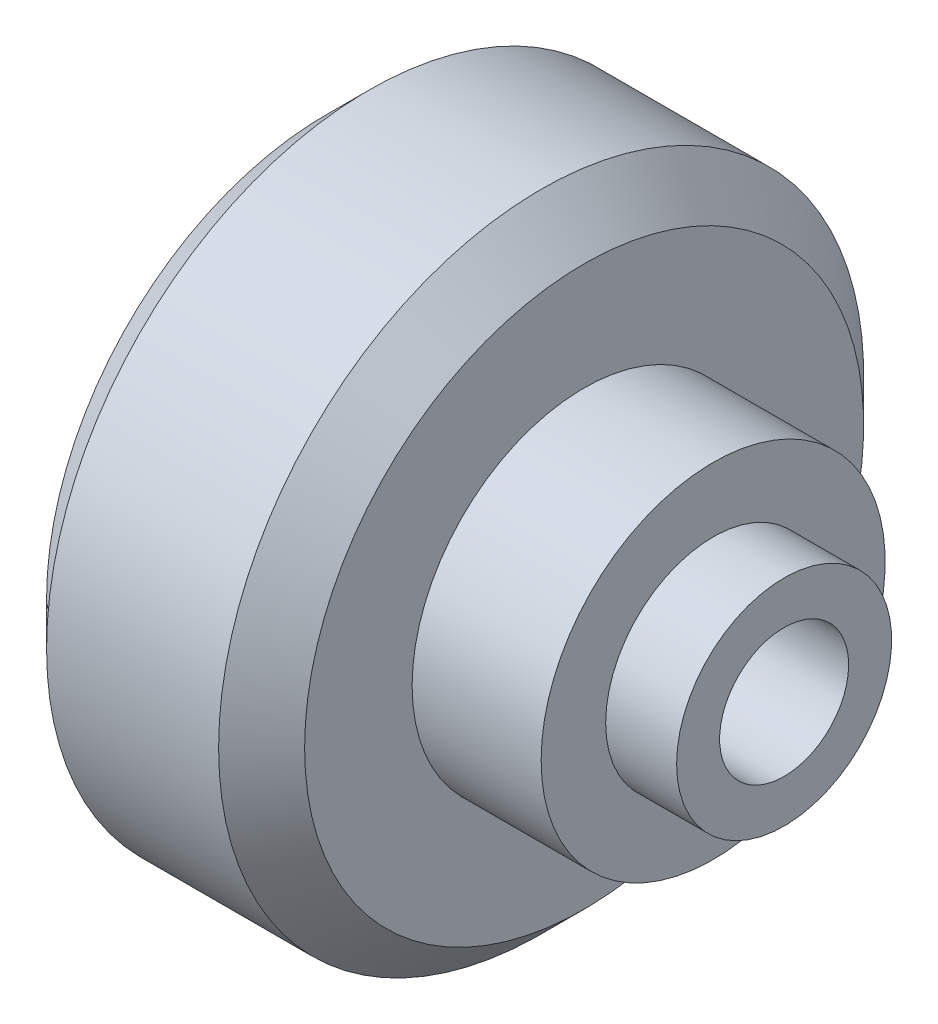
from build123d import *

# Parameters (mm, degrees)
SKETCH2_R          = 3
CUT_EXTRUDE1_DEPTH = 31.061437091
SKETCH3_R          = 8
CUT_EXTRUDE2_DEPTH = 5


with BuildPart() as part:
    # Sketch1 → Revolve1 (revolve)
    with BuildSketch(Plane(origin=(0, 0, 0), x_dir=(1, 0, 0), z_dir=(0, 1, 0)), mode=Mode.PRIVATE) as revolve1_sk:
        Polygon((0, 0), (21.3, 0), (21.3, 5), (18, 5), (18, 8), (12, 8), (12, 13), (10, 15), (2, 15), (0, 13), align=None)
    revolve(revolve1_sk.sketch.rotate(Axis((0, 0, 0), (1, 0, 0)), 180), axis=Axis((0, 0, 0), (1, 0, 0)))

    # Sketch2 → Cut-Extrude1 (cut, through all)
    with BuildSketch(Plane(origin=(21.3, 0, 0), x_dir=(0, 0, -1), z_dir=(1, 0, 0))):
        Circle(SKETCH2_R)
    extrude(amount=-CUT_EXTRUDE1_DEPTH, mode=Mode.SUBTRACT)

    # Sketch3 → Cut-Extrude2 (cut)
    with BuildSketch(Plane.ZY):
        Circle(SKETCH3_R)
    extrude(amount=-CUT_EXTRUDE2_DEPTH, mode=Mode.SUBTRACT)


solid = part.part
